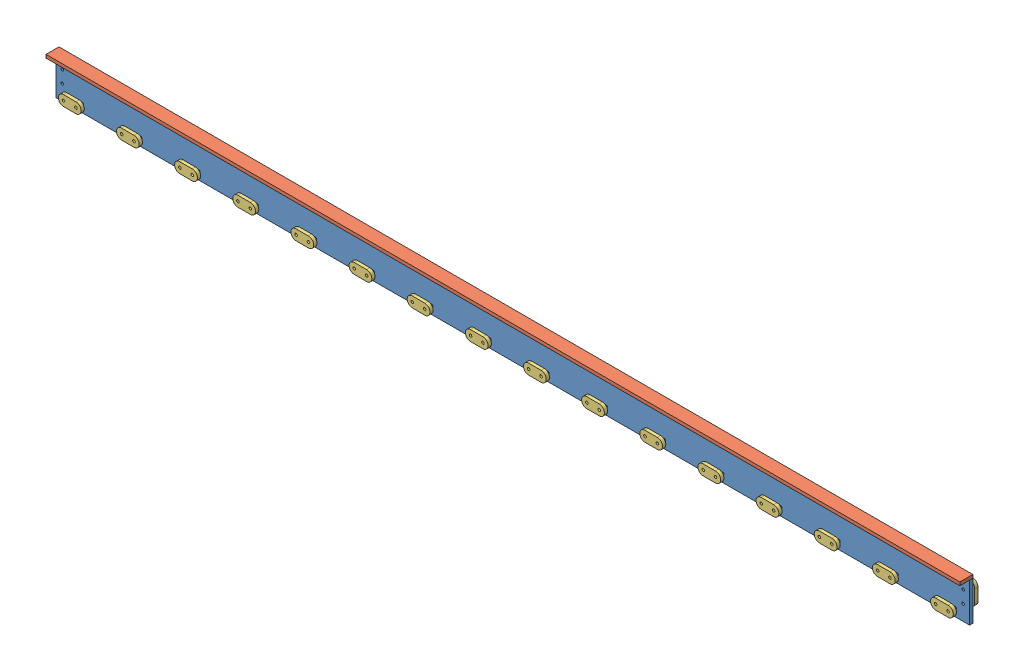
SolidWorks assembly fs-bs-angled-mount-assembly.SLDASM, configuration Default (file format 9000). Lengths in mm.
Overall size (1784.35 82.55 38).
20 component instances, 3 part files, 7 mates.
Components (placement in the parent):
- fs-bs-angled-mount-vertical-component-1: fs-bs-angled-mount-vertical-component.SLDPRT [Default] at origin size (1784.35 76.2 6.35)
- fs-bs-angled-mount-horizontal-component-1: fs-bs-angled-mount-horizontal-component.SLDPRT [Default] at (892.175 76.2 12.7) size (1784.35 6.35 25.4)
- fs-clamp-1: fs-clamp.SLDPRT [Default] at (27.94 15.24 12.8007) size (44.45 20.32 6.35)
- fs-clamp-2: fs-clamp.SLDPRT [Default] at (141.478 15.24 12.8007) size (44.45 20.32 6.35)
- fs-clamp-3: fs-clamp.SLDPRT [Default] at (255.016 15.24 12.8007) size (44.45 20.32 6.35)
- fs-clamp-4: fs-clamp.SLDPRT [Default] at (368.554 15.24 12.8007) size (44.45 20.32 6.35)
- fs-clamp-5: fs-clamp.SLDPRT [Default] at (482.092 15.24 12.8007) size (44.45 20.32 6.35)
- fs-clamp-6: fs-clamp.SLDPRT [Default] at (595.63 15.24 12.8007) size (44.45 20.32 6.35)
- fs-clamp-7: fs-clamp.SLDPRT [Default] at (709.168 15.24 12.8007) size (44.45 20.32 6.35)
- fs-clamp-8: fs-clamp.SLDPRT [Default] at (822.706 15.24 12.8007) size (44.45 20.32 6.35)
- fs-clamp-9: fs-clamp.SLDPRT [Default] at (936.244 15.24 12.8007) size (44.45 20.32 6.35)
- fs-clamp-10: fs-clamp.SLDPRT [Default] at (1049.782 15.24 12.8007) size (44.45 20.32 6.35)
- fs-clamp-11: fs-clamp.SLDPRT [Default] at (1163.32 15.24 12.8007) size (44.45 20.32 6.35)
- fs-clamp-12: fs-clamp.SLDPRT [Default] at (1276.858 15.24 12.8007) size (44.45 20.32 6.35)
- fs-clamp-13: fs-clamp.SLDPRT [Default] at (1390.396 15.24 12.8007) size (44.45 20.32 6.35)
- fs-clamp-14: fs-clamp.SLDPRT [Default] at (1503.934 15.24 12.8007) size (44.45 20.32 6.35)
- fs-clamp-15: fs-clamp.SLDPRT [Default] at (1617.472 15.24 12.8007) size (44.45 20.32 6.35)
- fs-clamp-16: fs-clamp.SLDPRT [Default] at (1731.01 15.24 12.8007) size (44.45 20.32 6.35)
- fs-clamp-19: fs-clamp.SLDPRT [Default] at (12.7 53.975 -12.5735) x (0 -1 0) z (0 0 1) size (44.45 20.32 6.35)
- fs-clamp-20: fs-clamp.SLDPRT [Default] at (1771.65 29.845 -12.5985) x (0 1 0) z (0 0 1) size (44.45 20.32 6.35)
Mates (geometry in assembly coordinates):
- Coincident2: coincident aligned: line of fs-bs-angled-mount-vertical-component-1 through (1784.35 1784.35 76.2) axis (0 -1 0); line of fs-bs-angled-mount-horizontal-component-1 through (1784.35 1784.35 76.2) axis (0 -1 0)
- Coincident3: coincident anti-aligned: line of fs-bs-angled-mount-vertical-component-1 through (0 76.2 6.35) axis (0 0 -1); line of fs-bs-angled-mount-horizontal-component-1 through (0 76.2 0) axis (0 0 1)
- Concentric1: concentric anti-aligned: cylinder of fs-bs-angled-mount-vertical-component-1 through (27.94 15.24 -7.1842) axis (0 0 1) radius 2.54; cylinder of fs-clamp-1 through (27.94 15.24 19.1507) axis (0 0 -1) radius 2.54
- Concentric3: concentric anti-aligned: cylinder of fs-bs-angled-mount-vertical-component-1 through (12.7 53.975 -7.1842) axis (0 0 1) radius 2.54; cylinder of fs-clamp-19 through (12.7 53.975 -6.2235) axis (0 0 -1) radius 2.54
- Concentric4: concentric anti-aligned: cylinder of fs-bs-angled-mount-vertical-component-1 through (12.7 29.845 -7.1842) axis (0 0 1) radius 2.54; cylinder of fs-clamp-19 through (12.7 29.845 -6.2235) axis (0 0 -1) radius 2.54
- Concentric5: concentric anti-aligned: cylinder of fs-bs-angled-mount-vertical-component-1 through (1771.65 53.975 -7.1842) axis (0 0 1) radius 2.54; cylinder of fs-clamp-20 through (1771.65 53.975 -6.2485) axis (0 0 -1) radius 10.16
- Concentric6: concentric anti-aligned: cylinder of fs-bs-angled-mount-vertical-component-1 through (1771.65 29.845 -7.1842) axis (0 0 1) radius 2.54; cylinder of fs-clamp-20 through (1771.65 29.845 -6.2485) axis (0 0 -1) radius 2.54
